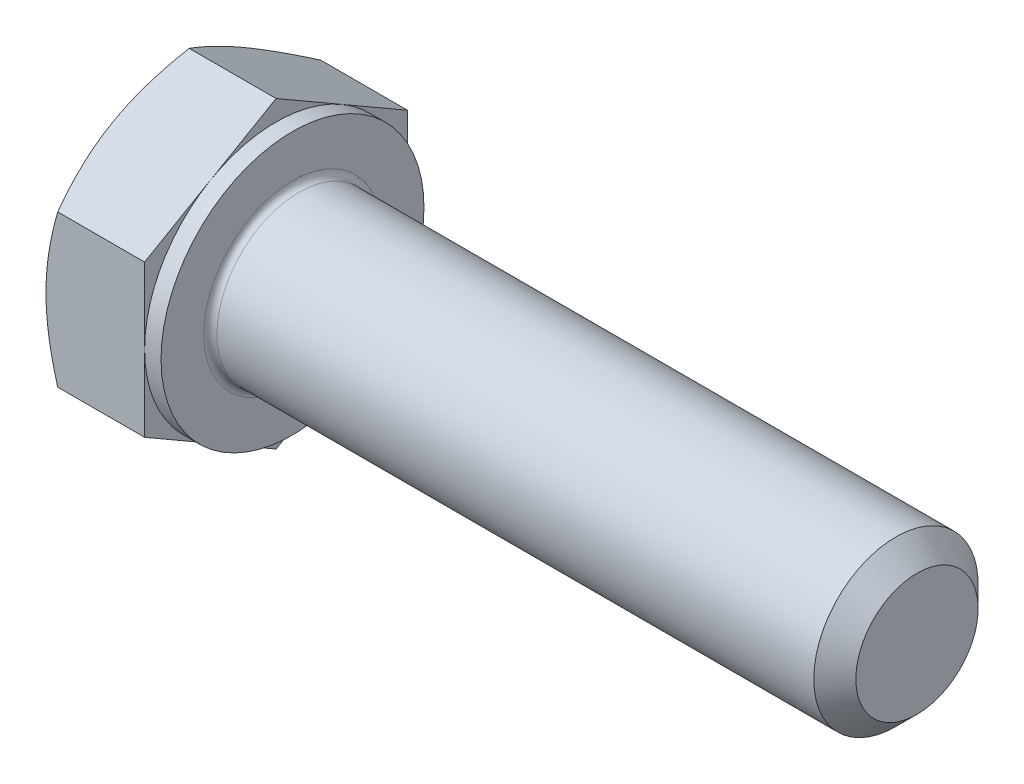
from build123d import *

# Parameters (mm, degrees)
EXTRUDE_348_DEPTH = 3.5
SKETCH_4_W        = 0.5
SKETCH_4_H        = 10.618802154
CHAMFER_1847_SIZE = 0.64
FILLET_1892_R     = 0.2


with BuildPart() as part:
    # Sketch 1 → Extrude 348 (new body)
    with BuildSketch(Plane(origin=(0, 0, 0), x_dir=(0, 0, -1), z_dir=(1, 0, 0))):
        Polygon((4, 2.309401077), (4, -2.309401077), (0, -4.618802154), (-4, -2.309401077), (-4, 2.309401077), (0, 4.618802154), align=None)
    extrude(amount=EXTRUDE_348_DEPTH)

    # Sketch 2 → Revolve 1 (revolve)
    with BuildSketch(Plane.XY, mode=Mode.PRIVATE) as revolve_1_sk:
        Polygon((0, 0), (22.5, 0), (22.5, 1.8072), (22.5, 2.5), (0, 2.5), align=None)
    revolve(revolve_1_sk.sketch.rotate(Axis((0, 0, 0), (1, 0, 0)), 90), axis=Axis((0, 0, 0), (1, 0, 0)))

    # Sketch 3 → Cut-Revolve 1 (revolve, cut)
    with BuildSketch(Plane.XY):
        Polygon((0, 4), (3.244016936, 9.618802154), (3.244016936, 14.618802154), (-10, 14.618802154), (-10, 4), align=None)
    revolve(axis=Axis((0, 0, 0), (1, 0, 0)), mode=Mode.SUBTRACT)

    # Sketch 5 → Cut-Revolve 2 (revolve, cut)
    with BuildSketch(Plane.XY):
        Polygon((3.5, 4), (0.255983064, 9.618802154), (0.255983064, 14.618802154), (10.255983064, 14.618802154), (10.255983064, 4), align=None)
    revolve(axis=Axis((0, 0, 0), (1, 0, 0)), mode=Mode.SUBTRACT)

    # Sketch 4 → Cut-Revolve 3 (revolve, cut)
    with BuildSketch(Plane.XY, mode=Mode.PRIVATE) as cut_revolve_3_sk:
        with Locations((3.25, 9.309401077)):
            Rectangle(SKETCH_4_W, SKETCH_4_H)
    revolve(cut_revolve_3_sk.sketch.rotate(Axis((0, 0, 0), (1, 0, 0)), 270), axis=Axis((0, 0, 0), (1, 0, 0)), mode=Mode.SUBTRACT)

    # Chamfer 1847
    chamfer_1847_edges = [part.edges().sort_by_distance(p)[0] for p in [
        (22.5, 0, -2.5),
    ]]
    chamfer(chamfer_1847_edges, length=CHAMFER_1847_SIZE)

    # Fillet 1892
    fillet_1892_edges = [part.edges().sort_by_distance(p)[0] for p in [
        (3.5, 0, -2.5),
    ]]
    fillet(fillet_1892_edges, radius=FILLET_1892_R)


solid = part.part
